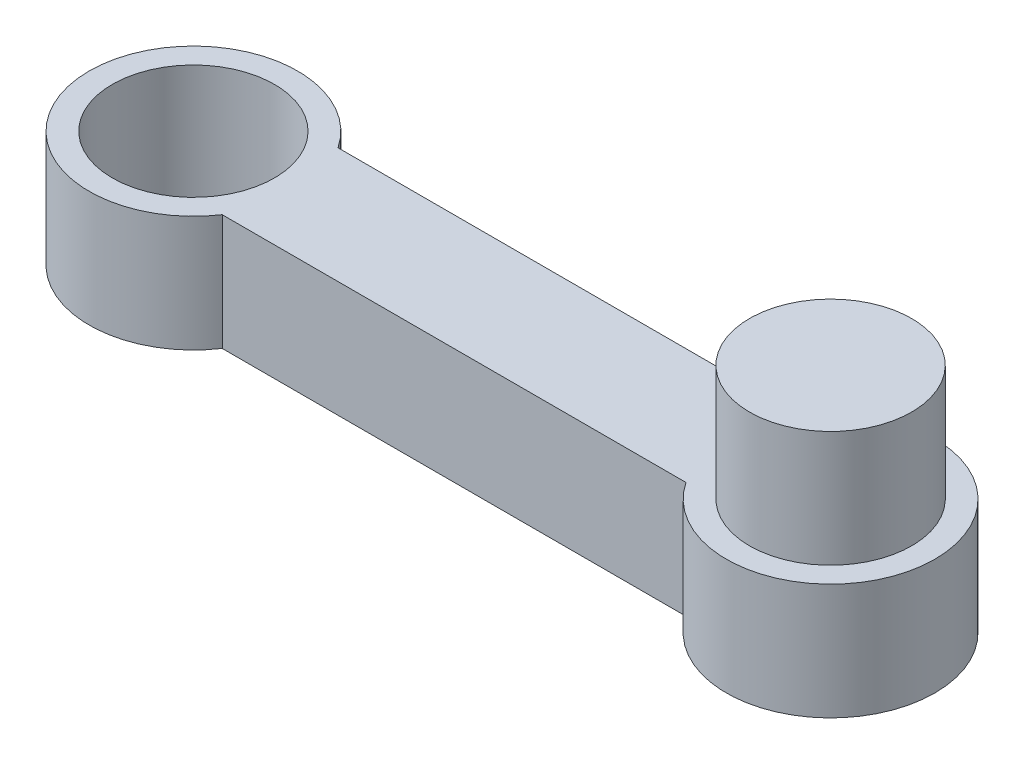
from build123d import *

# Parameters (mm, degrees)
BOSS_EXTRUDE1_DEPTH = 100
SKETCH2_R           = 70
CUT_EXTRUDE1_DEPTH  = 100
SKETCH3_R           = 70
BOSS_EXTRUDE2_DEPTH = 100


with BuildPart() as part:
    # Sketch1 → Boss-Extrude1 (new body)
    with BuildSketch(Plane(origin=(0, 0, 0), x_dir=(1, 0, 0), z_dir=(0, 1, 0))):
        with BuildLine():
            Line((-242.625717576, 275.741810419), (-242.625717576, 275.992438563))
            Line((-242.625717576, 275.992438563), (157.374282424, 275.992438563))
            Line((157.374282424, 275.992438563), (157.374282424, 275.741810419))
            ThreePointArc((157.374282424, 275.741810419), (322.374282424, 225.992438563), (157.374282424, 176.243066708))
            Line((157.374282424, 176.243066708), (157.374282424, 175.992438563))
            Line((157.374282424, 175.992438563), (-242.625717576, 175.992438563))
            Line((-242.625717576, 175.992438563), (-242.625717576, 176.243066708))
            ThreePointArc((-242.625717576, 176.243066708), (-407.625717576, 225.992438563), (-242.625717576, 275.741810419))
        make_face()
    extrude(amount=BOSS_EXTRUDE1_DEPTH)

    # Sketch2 → Cut-Extrude1 (cut)
    with BuildSketch(Plane(origin=(0, 100, 0), x_dir=(1, 0, 0), z_dir=(0, 1, 0))):
        with Locations(Location((-317.625717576, 225.992438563, 0), (0, 0, 270))):
            Circle(SKETCH2_R)
    extrude(amount=-CUT_EXTRUDE1_DEPTH, mode=Mode.SUBTRACT)

    # Sketch3 → Boss-Extrude2 (add)
    with BuildSketch(Plane(origin=(0, 100, 0), x_dir=(1, 0, 0), z_dir=(0, 1, 0))):
        with Locations(Location((232.374282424, 225.992438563, 0), (0, 0, 270))):
            Circle(SKETCH3_R)
    extrude(amount=BOSS_EXTRUDE2_DEPTH)


solid = part.part
